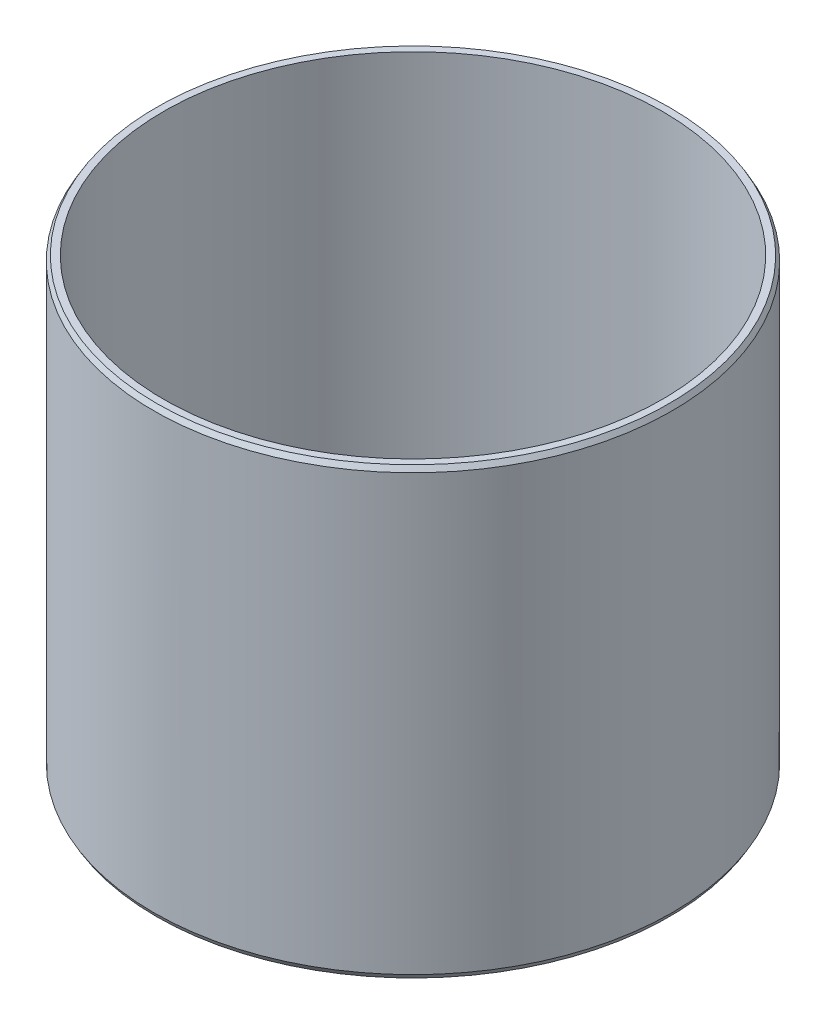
from build123d import *

# Parameters (mm, degrees)
ESQUISSE2_R      = 52.5
ESQUISSE2_R_2    = 50.5
EXTRUSION1_DEPTH = 90
CHANFREIN1_SIZE  = 1
CHANFREIN1_SIZE2 = 0.577350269


with BuildPart() as part:
    # Esquisse2 → Extrusion1 (new body)
    with BuildSketch(Plane(origin=(0, 0, 0), x_dir=(1, 0, 0), z_dir=(0, 1, 0))):
        with Locations(Location((0, 0, 0), (0, 0, 90))):
            Circle(ESQUISSE2_R)
        with Locations(Location((0, 0, 0), (0, 0, 90))):
            Circle(ESQUISSE2_R_2, mode=Mode.SUBTRACT)
    extrude(amount=EXTRUSION1_DEPTH)

    # Chanfrein1
    chanfrein1_edges = [part.edges().sort_by_distance(p)[0] for p in [
        (0, 0, 52.5),
        (0, 90, 52.5),
    ]]
    chanfrein1_side = [part.faces().sort_by_distance(p)[0] for p in [
        (0, 45, 52.5),
    ]]
    chamfer(chanfrein1_edges, length=CHANFREIN1_SIZE, length2=CHANFREIN1_SIZE2, reference=chanfrein1_side[0])


solid = part.part
